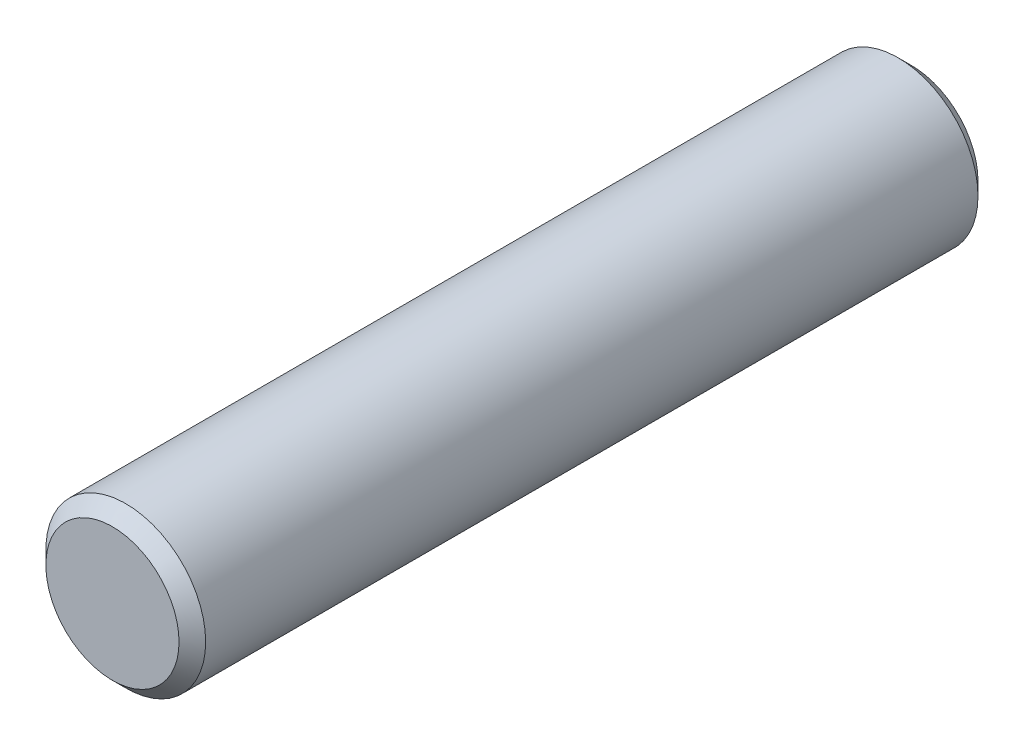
ISO-10303-21;
HEADER;
FILE_DESCRIPTION(('STEP AP214'),'2;1');
FILE_NAME('part.step','',(''),(''),'','','');
FILE_SCHEMA(('AUTOMOTIVE_DESIGN { 1 0 10303 214 1 1 1 1 }'));
ENDSEC;
DATA;
#1=APPLICATION_CONTEXT('core data for automotive mechanical design processes');
#2=APPLICATION_PROTOCOL_DEFINITION('international standard','automotive_design',2000,#1);
#3=PRODUCT_CONTEXT('',#1,'mechanical');
#4=PRODUCT('Part','Part','',(#3));
#5=PRODUCT_RELATED_PRODUCT_CATEGORY('part','',(#4));
#6=PRODUCT_DEFINITION_FORMATION('','',#4);
#7=PRODUCT_DEFINITION_CONTEXT('part definition',#1,'design');
#8=PRODUCT_DEFINITION('design','',#6,#7);
#9=PRODUCT_DEFINITION_SHAPE('','',#8);
#10=(LENGTH_UNIT() NAMED_UNIT(*) SI_UNIT(.MILLI.,.METRE.));
#11=(NAMED_UNIT(*) PLANE_ANGLE_UNIT() SI_UNIT($,.RADIAN.));
#12=(NAMED_UNIT(*) SI_UNIT($,.STERADIAN.) SOLID_ANGLE_UNIT());
#13=UNCERTAINTY_MEASURE_WITH_UNIT(LENGTH_MEASURE(1.E-05),#10,'distance_accuracy_value','');
#14=(GEOMETRIC_REPRESENTATION_CONTEXT(3) GLOBAL_UNCERTAINTY_ASSIGNED_CONTEXT((#13)) GLOBAL_UNIT_ASSIGNED_CONTEXT((#10,
#11,#12)) REPRESENTATION_CONTEXT('',''));
#15=CARTESIAN_POINT('',(0.,0.,0.));
#16=DIRECTION('',(0.,0.,1.));
#17=DIRECTION('',(1.,0.,0.));
#18=AXIS2_PLACEMENT_3D('',#15,#16,#17);
#19=CARTESIAN_POINT('',(0.,0.,30.));
#20=DIRECTION('',(0.,0.,-1.));
#21=DIRECTION('',(-1.,0.,0.));
#22=AXIS2_PLACEMENT_3D('',#19,#20,#21);
#23=CYLINDRICAL_SURFACE('',#22,3.);
#24=CARTESIAN_POINT('',(0.,0.,29.5));
#25=DIRECTION('',(0.,0.,1.));
#26=DIRECTION('',(1.,0.,0.));
#27=AXIS2_PLACEMENT_3D('',#24,#25,#26);
#28=CIRCLE('',#27,3.);
#29=CARTESIAN_POINT('',(3.,0.,29.5));
#30=VERTEX_POINT('',#29);
#31=EDGE_CURVE('E36',#30,#30,#28,.F.);
#32=ORIENTED_EDGE('',*,*,#31,.T.);
#33=EDGE_LOOP('',(#32));
#34=FACE_BOUND('',#33,.T.);
#35=CARTESIAN_POINT('',(0.,0.,0.500000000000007));
#36=DIRECTION('',(0.,0.,1.));
#37=DIRECTION('',(1.,0.,0.));
#38=AXIS2_PLACEMENT_3D('',#35,#36,#37);
#39=CIRCLE('',#38,3.);
#40=CARTESIAN_POINT('',(3.,0.,0.500000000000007));
#41=VERTEX_POINT('',#40);
#42=EDGE_CURVE('E40',#41,#41,#39,.T.);
#43=ORIENTED_EDGE('',*,*,#42,.T.);
#44=EDGE_LOOP('',(#43));
#45=FACE_BOUND('',#44,.T.);
#46=ADVANCED_FACE('F30',(#34,#45),#23,.T.);
#47=CARTESIAN_POINT('',(0.,0.,30.));
#48=DIRECTION('',(0.,0.,1.));
#49=DIRECTION('',(1.,0.,0.));
#50=AXIS2_PLACEMENT_3D('',#47,#48,#49);
#51=PLANE('',#50);
#52=CARTESIAN_POINT('',(0.,0.,30.));
#53=DIRECTION('',(0.,0.,1.));
#54=DIRECTION('',(1.,0.,0.));
#55=AXIS2_PLACEMENT_3D('',#52,#53,#54);
#56=CIRCLE('',#55,2.5);
#57=CARTESIAN_POINT('',(2.5,0.,30.));
#58=VERTEX_POINT('',#57);
#59=EDGE_CURVE('E44',#58,#58,#56,.T.);
#60=ORIENTED_EDGE('',*,*,#59,.T.);
#61=EDGE_LOOP('',(#60));
#62=FACE_BOUND('',#61,.T.);
#63=ADVANCED_FACE('F50',(#62),#51,.T.);
#64=CARTESIAN_POINT('',(0.,0.,0.));
#65=DIRECTION('',(0.,0.,1.));
#66=DIRECTION('',(1.,0.,0.));
#67=AXIS2_PLACEMENT_3D('',#64,#65,#66);
#68=PLANE('',#67);
#69=CARTESIAN_POINT('',(0.,0.,0.));
#70=DIRECTION('',(0.,0.,1.));
#71=DIRECTION('',(1.,0.,0.));
#72=AXIS2_PLACEMENT_3D('',#69,#70,#71);
#73=CIRCLE('',#72,2.5);
#74=CARTESIAN_POINT('',(2.5,0.,0.));
#75=VERTEX_POINT('',#74);
#76=EDGE_CURVE('E10',#75,#75,#73,.F.);
#77=ORIENTED_EDGE('',*,*,#76,.T.);
#78=EDGE_LOOP('',(#77));
#79=FACE_BOUND('',#78,.T.);
#80=ADVANCED_FACE('F55',(#79),#68,.F.);
#81=CARTESIAN_POINT('',(0.,0.,30.));
#82=DIRECTION('',(0.,0.,-1.));
#83=DIRECTION('',(-1.,0.,0.));
#84=AXIS2_PLACEMENT_3D('',#81,#82,#83);
#85=CONICAL_SURFACE('',#84,2.5,0.785398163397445);
#86=ORIENTED_EDGE('',*,*,#31,.F.);
#87=EDGE_LOOP('',(#86));
#88=FACE_BOUND('',#87,.T.);
#89=ORIENTED_EDGE('',*,*,#59,.F.);
#90=EDGE_LOOP('',(#89));
#91=FACE_BOUND('',#90,.T.);
#92=ADVANCED_FACE('F52',(#88,#91),#85,.T.);
#93=CARTESIAN_POINT('',(0.,0.,0.500000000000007));
#94=DIRECTION('',(0.,0.,1.));
#95=DIRECTION('',(1.,0.,0.));
#96=AXIS2_PLACEMENT_3D('',#93,#94,#95);
#97=CONICAL_SURFACE('',#96,3.,0.785398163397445);
#98=ORIENTED_EDGE('',*,*,#76,.F.);
#99=EDGE_LOOP('',(#98));
#100=FACE_BOUND('',#99,.T.);
#101=ORIENTED_EDGE('',*,*,#42,.F.);
#102=EDGE_LOOP('',(#101));
#103=FACE_BOUND('',#102,.T.);
#104=ADVANCED_FACE('F54',(#100,#103),#97,.T.);
#105=CLOSED_SHELL('',(#46,#63,#80,#92,#104));
#106=MANIFOLD_SOLID_BREP('B2',#105);
#107=ADVANCED_BREP_SHAPE_REPRESENTATION('',(#18,#106),#14);
#108=SHAPE_DEFINITION_REPRESENTATION(#9,#107);
ENDSEC;
END-ISO-10303-21;
